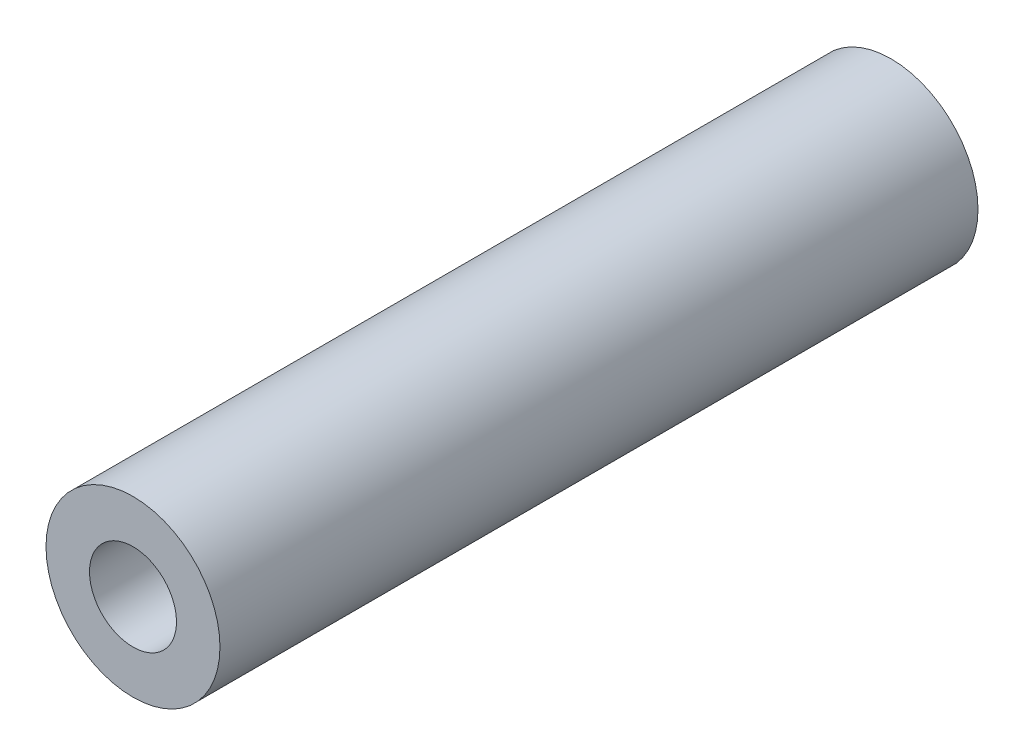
ISO-10303-21;
HEADER;
FILE_DESCRIPTION(('STEP AP214'),'2;1');
FILE_NAME('part.step','',(''),(''),'','','');
FILE_SCHEMA(('AUTOMOTIVE_DESIGN { 1 0 10303 214 1 1 1 1 }'));
ENDSEC;
DATA;
#1=APPLICATION_CONTEXT('core data for automotive mechanical design processes');
#2=APPLICATION_PROTOCOL_DEFINITION('international standard','automotive_design',2000,#1);
#3=PRODUCT_CONTEXT('',#1,'mechanical');
#4=PRODUCT('Part','Part','',(#3));
#5=PRODUCT_RELATED_PRODUCT_CATEGORY('part','',(#4));
#6=PRODUCT_DEFINITION_FORMATION('','',#4);
#7=PRODUCT_DEFINITION_CONTEXT('part definition',#1,'design');
#8=PRODUCT_DEFINITION('design','',#6,#7);
#9=PRODUCT_DEFINITION_SHAPE('','',#8);
#10=(LENGTH_UNIT() NAMED_UNIT(*) SI_UNIT(.MILLI.,.METRE.));
#11=(NAMED_UNIT(*) PLANE_ANGLE_UNIT() SI_UNIT($,.RADIAN.));
#12=(NAMED_UNIT(*) SI_UNIT($,.STERADIAN.) SOLID_ANGLE_UNIT());
#13=UNCERTAINTY_MEASURE_WITH_UNIT(LENGTH_MEASURE(1.E-05),#10,'distance_accuracy_value','');
#14=(GEOMETRIC_REPRESENTATION_CONTEXT(3) GLOBAL_UNCERTAINTY_ASSIGNED_CONTEXT((#13)) GLOBAL_UNIT_ASSIGNED_CONTEXT((#10,
#11,#12)) REPRESENTATION_CONTEXT('',''));
#15=CARTESIAN_POINT('',(0.,0.,0.));
#16=DIRECTION('',(0.,0.,1.));
#17=DIRECTION('',(1.,0.,0.));
#18=AXIS2_PLACEMENT_3D('',#15,#16,#17);
#19=CARTESIAN_POINT('',(0.,0.,15.25));
#20=DIRECTION('',(0.,0.,1.));
#21=DIRECTION('',(1.,0.,0.));
#22=AXIS2_PLACEMENT_3D('',#19,#20,#21);
#23=PLANE('',#22);
#24=CARTESIAN_POINT('',(0.,0.,15.25));
#25=DIRECTION('',(0.,0.,1.));
#26=DIRECTION('',(1.,0.,0.));
#27=AXIS2_PLACEMENT_3D('',#24,#25,#26);
#28=CIRCLE('',#27,3.5);
#29=CARTESIAN_POINT('',(-3.5,0.,15.25));
#30=VERTEX_POINT('',#29);
#31=EDGE_CURVE('E10',#30,#30,#28,.T.);
#32=ORIENTED_EDGE('',*,*,#31,.T.);
#33=EDGE_LOOP('',(#32));
#34=FACE_BOUND('',#33,.T.);
#35=CARTESIAN_POINT('',(0.,0.,15.25));
#36=DIRECTION('',(0.,0.,1.));
#37=DIRECTION('',(1.,0.,0.));
#38=AXIS2_PLACEMENT_3D('',#35,#36,#37);
#39=CIRCLE('',#38,1.75);
#40=CARTESIAN_POINT('',(-1.75,0.,15.25));
#41=VERTEX_POINT('',#40);
#42=EDGE_CURVE('E42',#41,#41,#39,.T.);
#43=ORIENTED_EDGE('',*,*,#42,.F.);
#44=EDGE_LOOP('',(#43));
#45=FACE_BOUND('',#44,.T.);
#46=ADVANCED_FACE('F31',(#34,#45),#23,.T.);
#47=CARTESIAN_POINT('',(0.,0.,-15.25));
#48=DIRECTION('',(0.,0.,1.));
#49=DIRECTION('',(1.,0.,0.));
#50=AXIS2_PLACEMENT_3D('',#47,#48,#49);
#51=PLANE('',#50);
#52=CARTESIAN_POINT('',(0.,0.,-15.25));
#53=DIRECTION('',(0.,0.,1.));
#54=DIRECTION('',(1.,0.,0.));
#55=AXIS2_PLACEMENT_3D('',#52,#53,#54);
#56=CIRCLE('',#55,3.5);
#57=CARTESIAN_POINT('',(-3.5,0.,-15.25));
#58=VERTEX_POINT('',#57);
#59=EDGE_CURVE('E35',#58,#58,#56,.T.);
#60=ORIENTED_EDGE('',*,*,#59,.F.);
#61=EDGE_LOOP('',(#60));
#62=FACE_BOUND('',#61,.T.);
#63=CARTESIAN_POINT('',(0.,0.,-15.25));
#64=DIRECTION('',(0.,0.,1.));
#65=DIRECTION('',(1.,0.,0.));
#66=AXIS2_PLACEMENT_3D('',#63,#64,#65);
#67=CIRCLE('',#66,1.75);
#68=CARTESIAN_POINT('',(-1.75,0.,-15.25));
#69=VERTEX_POINT('',#68);
#70=EDGE_CURVE('E44',#69,#69,#67,.T.);
#71=ORIENTED_EDGE('',*,*,#70,.T.);
#72=EDGE_LOOP('',(#71));
#73=FACE_BOUND('',#72,.T.);
#74=ADVANCED_FACE('F54',(#62,#73),#51,.F.);
#75=CARTESIAN_POINT('',(0.,0.,15.25));
#76=DIRECTION('',(0.,0.,-1.));
#77=DIRECTION('',(-1.,0.,0.));
#78=AXIS2_PLACEMENT_3D('',#75,#76,#77);
#79=CYLINDRICAL_SURFACE('',#78,3.5);
#80=CARTESIAN_POINT('',(-3.5,0.,15.25));
#81=CARTESIAN_POINT('',(-3.5,0.,14.9322916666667));
#82=CARTESIAN_POINT('',(-3.5,0.,14.6145833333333));
#83=CARTESIAN_POINT('',(-3.5,0.,13.9791666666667));
#84=CARTESIAN_POINT('',(-3.5,0.,13.6614583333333));
#85=CARTESIAN_POINT('',(-3.5,0.,13.0260416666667));
#86=CARTESIAN_POINT('',(-3.5,0.,12.7083333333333));
#87=CARTESIAN_POINT('',(-3.5,0.,12.0729166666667));
#88=CARTESIAN_POINT('',(-3.5,0.,11.7552083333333));
#89=CARTESIAN_POINT('',(-3.5,0.,11.1197916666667));
#90=CARTESIAN_POINT('',(-3.5,0.,10.8020833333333));
#91=CARTESIAN_POINT('',(-3.5,0.,10.1666666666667));
#92=CARTESIAN_POINT('',(-3.5,0.,9.84895833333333));
#93=CARTESIAN_POINT('',(-3.5,0.,9.21354166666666));
#94=CARTESIAN_POINT('',(-3.5,0.,8.89583333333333));
#95=CARTESIAN_POINT('',(-3.5,0.,8.26041666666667));
#96=CARTESIAN_POINT('',(-3.5,0.,7.94270833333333));
#97=CARTESIAN_POINT('',(-3.5,0.,7.30729166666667));
#98=CARTESIAN_POINT('',(-3.5,0.,6.98958333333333));
#99=CARTESIAN_POINT('',(-3.5,0.,6.35416666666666));
#100=CARTESIAN_POINT('',(-3.5,0.,6.03645833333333));
#101=CARTESIAN_POINT('',(-3.5,0.,5.40104166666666));
#102=CARTESIAN_POINT('',(-3.5,0.,5.08333333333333));
#103=CARTESIAN_POINT('',(-3.5,0.,4.44791666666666));
#104=CARTESIAN_POINT('',(-3.5,0.,4.13020833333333));
#105=CARTESIAN_POINT('',(-3.5,0.,3.49479166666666));
#106=CARTESIAN_POINT('',(-3.5,0.,3.17708333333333));
#107=CARTESIAN_POINT('',(-3.5,0.,2.54166666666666));
#108=CARTESIAN_POINT('',(-3.5,0.,2.22395833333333));
#109=CARTESIAN_POINT('',(-3.5,0.,1.58854166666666));
#110=CARTESIAN_POINT('',(-3.5,0.,1.27083333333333));
#111=CARTESIAN_POINT('',(-3.5,0.,0.635416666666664));
#112=CARTESIAN_POINT('',(-3.5,0.,0.31770833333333));
#113=CARTESIAN_POINT('',(-3.5,0.,-0.317708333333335));
#114=CARTESIAN_POINT('',(-3.5,0.,-0.635416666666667));
#115=CARTESIAN_POINT('',(-3.5,0.,-1.27083333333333));
#116=CARTESIAN_POINT('',(-3.5,0.,-1.58854166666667));
#117=CARTESIAN_POINT('',(-3.5,0.,-2.22395833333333));
#118=CARTESIAN_POINT('',(-3.5,0.,-2.54166666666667));
#119=CARTESIAN_POINT('',(-3.5,0.,-3.17708333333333));
#120=CARTESIAN_POINT('',(-3.5,0.,-3.49479166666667));
#121=CARTESIAN_POINT('',(-3.5,0.,-4.13020833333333));
#122=CARTESIAN_POINT('',(-3.5,0.,-4.44791666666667));
#123=CARTESIAN_POINT('',(-3.5,0.,-5.08333333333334));
#124=CARTESIAN_POINT('',(-3.5,0.,-5.40104166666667));
#125=CARTESIAN_POINT('',(-3.5,0.,-6.03645833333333));
#126=CARTESIAN_POINT('',(-3.5,0.,-6.35416666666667));
#127=CARTESIAN_POINT('',(-3.5,0.,-6.98958333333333));
#128=CARTESIAN_POINT('',(-3.5,0.,-7.30729166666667));
#129=CARTESIAN_POINT('',(-3.5,0.,-7.94270833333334));
#130=CARTESIAN_POINT('',(-3.5,0.,-8.26041666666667));
#131=CARTESIAN_POINT('',(-3.5,0.,-8.89583333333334));
#132=CARTESIAN_POINT('',(-3.5,0.,-9.21354166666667));
#133=CARTESIAN_POINT('',(-3.5,0.,-9.84895833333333));
#134=CARTESIAN_POINT('',(-3.5,0.,-10.1666666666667));
#135=CARTESIAN_POINT('',(-3.5,0.,-10.8020833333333));
#136=CARTESIAN_POINT('',(-3.5,0.,-11.1197916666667));
#137=CARTESIAN_POINT('',(-3.5,0.,-11.7552083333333));
#138=CARTESIAN_POINT('',(-3.5,0.,-12.0729166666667));
#139=CARTESIAN_POINT('',(-3.5,0.,-12.7083333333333));
#140=CARTESIAN_POINT('',(-3.5,0.,-13.0260416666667));
#141=CARTESIAN_POINT('',(-3.5,0.,-13.6614583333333));
#142=CARTESIAN_POINT('',(-3.5,0.,-13.9791666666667));
#143=CARTESIAN_POINT('',(-3.5,0.,-14.6145833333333));
#144=CARTESIAN_POINT('',(-3.5,0.,-14.9322916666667));
#145=CARTESIAN_POINT('',(-3.5,0.,-15.25));
#146=B_SPLINE_CURVE_WITH_KNOTS('',3,(#80,#81,#82,#83,#84,#85,#86,#87,#88,#89,#90,#91,#92,#93,
#94,#95,#96,#97,#98,#99,#100,#101,#102,#103,#104,#105,#106,#107,#108,#109,#110,#111,#112,#113,
#114,#115,#116,#117,#118,#119,#120,#121,#122,#123,#124,#125,#126,#127,#128,#129,#130,#131,#132,
#133,#134,#135,#136,#137,#138,#139,#140,#141,#142,#143,#144,#145),.UNSPECIFIED.,.F.,.F.,(4,2,2,
2,2,2,2,2,2,2,2,2,2,2,2,2,2,2,2,2,2,2,2,2,2,2,2,2,2,2,2,2,4),(0.,0.953124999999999,1.90625,
2.859375,3.8125,4.765625,5.71875,6.671875,7.625,8.578125,9.53125,10.484375,11.4375,12.390625,
13.34375,14.296875,15.25,16.203125,17.15625,18.109375,19.0625,20.015625,20.96875,21.921875,
22.875,23.828125,24.78125,25.734375,26.6875,27.640625,28.59375,29.546875,30.5),.UNSPECIFIED.);
#147=EDGE_CURVE('BSEAM33',#30,#58,#146,.T.);
#148=ORIENTED_EDGE('',*,*,#31,.F.);
#149=ORIENTED_EDGE('',*,*,#59,.T.);
#150=ORIENTED_EDGE('',*,*,#147,.T.);
#151=ORIENTED_EDGE('',*,*,#147,.F.);
#152=EDGE_LOOP('',(#148,#150,#149,#151));
#153=FACE_BOUND('',#152,.T.);
#154=ADVANCED_FACE('F33',(#153),#79,.T.);
#155=CARTESIAN_POINT('',(0.,0.,15.25));
#156=DIRECTION('',(0.,0.,-1.));
#157=DIRECTION('',(-1.,0.,0.));
#158=AXIS2_PLACEMENT_3D('',#155,#156,#157);
#159=CYLINDRICAL_SURFACE('',#158,1.75);
#160=CARTESIAN_POINT('',(-1.75,0.,15.25));
#161=CARTESIAN_POINT('',(-1.75,0.,14.9322916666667));
#162=CARTESIAN_POINT('',(-1.75,0.,14.6145833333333));
#163=CARTESIAN_POINT('',(-1.75,0.,13.9791666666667));
#164=CARTESIAN_POINT('',(-1.75,0.,13.6614583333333));
#165=CARTESIAN_POINT('',(-1.75,0.,13.0260416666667));
#166=CARTESIAN_POINT('',(-1.75,0.,12.7083333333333));
#167=CARTESIAN_POINT('',(-1.75,0.,12.0729166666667));
#168=CARTESIAN_POINT('',(-1.75,0.,11.7552083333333));
#169=CARTESIAN_POINT('',(-1.75,0.,11.1197916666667));
#170=CARTESIAN_POINT('',(-1.75,0.,10.8020833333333));
#171=CARTESIAN_POINT('',(-1.75,0.,10.1666666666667));
#172=CARTESIAN_POINT('',(-1.75,0.,9.84895833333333));
#173=CARTESIAN_POINT('',(-1.75,0.,9.21354166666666));
#174=CARTESIAN_POINT('',(-1.75,0.,8.89583333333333));
#175=CARTESIAN_POINT('',(-1.75,0.,8.26041666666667));
#176=CARTESIAN_POINT('',(-1.75,0.,7.94270833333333));
#177=CARTESIAN_POINT('',(-1.75,0.,7.30729166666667));
#178=CARTESIAN_POINT('',(-1.75,0.,6.98958333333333));
#179=CARTESIAN_POINT('',(-1.75,0.,6.35416666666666));
#180=CARTESIAN_POINT('',(-1.75,0.,6.03645833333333));
#181=CARTESIAN_POINT('',(-1.75,0.,5.40104166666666));
#182=CARTESIAN_POINT('',(-1.75,0.,5.08333333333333));
#183=CARTESIAN_POINT('',(-1.75,0.,4.44791666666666));
#184=CARTESIAN_POINT('',(-1.75,0.,4.13020833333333));
#185=CARTESIAN_POINT('',(-1.75,0.,3.49479166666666));
#186=CARTESIAN_POINT('',(-1.75,0.,3.17708333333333));
#187=CARTESIAN_POINT('',(-1.75,0.,2.54166666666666));
#188=CARTESIAN_POINT('',(-1.75,0.,2.22395833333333));
#189=CARTESIAN_POINT('',(-1.75,0.,1.58854166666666));
#190=CARTESIAN_POINT('',(-1.75,0.,1.27083333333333));
#191=CARTESIAN_POINT('',(-1.75,0.,0.635416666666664));
#192=CARTESIAN_POINT('',(-1.75,0.,0.31770833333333));
#193=CARTESIAN_POINT('',(-1.75,0.,-0.317708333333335));
#194=CARTESIAN_POINT('',(-1.75,0.,-0.635416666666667));
#195=CARTESIAN_POINT('',(-1.75,0.,-1.27083333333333));
#196=CARTESIAN_POINT('',(-1.75,0.,-1.58854166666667));
#197=CARTESIAN_POINT('',(-1.75,0.,-2.22395833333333));
#198=CARTESIAN_POINT('',(-1.75,0.,-2.54166666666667));
#199=CARTESIAN_POINT('',(-1.75,0.,-3.17708333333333));
#200=CARTESIAN_POINT('',(-1.75,0.,-3.49479166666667));
#201=CARTESIAN_POINT('',(-1.75,0.,-4.13020833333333));
#202=CARTESIAN_POINT('',(-1.75,0.,-4.44791666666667));
#203=CARTESIAN_POINT('',(-1.75,0.,-5.08333333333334));
#204=CARTESIAN_POINT('',(-1.75,0.,-5.40104166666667));
#205=CARTESIAN_POINT('',(-1.75,0.,-6.03645833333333));
#206=CARTESIAN_POINT('',(-1.75,0.,-6.35416666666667));
#207=CARTESIAN_POINT('',(-1.75,0.,-6.98958333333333));
#208=CARTESIAN_POINT('',(-1.75,0.,-7.30729166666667));
#209=CARTESIAN_POINT('',(-1.75,0.,-7.94270833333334));
#210=CARTESIAN_POINT('',(-1.75,0.,-8.26041666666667));
#211=CARTESIAN_POINT('',(-1.75,0.,-8.89583333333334));
#212=CARTESIAN_POINT('',(-1.75,0.,-9.21354166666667));
#213=CARTESIAN_POINT('',(-1.75,0.,-9.84895833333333));
#214=CARTESIAN_POINT('',(-1.75,0.,-10.1666666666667));
#215=CARTESIAN_POINT('',(-1.75,0.,-10.8020833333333));
#216=CARTESIAN_POINT('',(-1.75,0.,-11.1197916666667));
#217=CARTESIAN_POINT('',(-1.75,0.,-11.7552083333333));
#218=CARTESIAN_POINT('',(-1.75,0.,-12.0729166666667));
#219=CARTESIAN_POINT('',(-1.75,0.,-12.7083333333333));
#220=CARTESIAN_POINT('',(-1.75,0.,-13.0260416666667));
#221=CARTESIAN_POINT('',(-1.75,0.,-13.6614583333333));
#222=CARTESIAN_POINT('',(-1.75,0.,-13.9791666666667));
#223=CARTESIAN_POINT('',(-1.75,0.,-14.6145833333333));
#224=CARTESIAN_POINT('',(-1.75,0.,-14.9322916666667));
#225=CARTESIAN_POINT('',(-1.75,0.,-15.25));
#226=B_SPLINE_CURVE_WITH_KNOTS('',3,(#160,#161,#162,#163,#164,#165,#166,#167,#168,#169,#170,
#171,#172,#173,#174,#175,#176,#177,#178,#179,#180,#181,#182,#183,#184,#185,#186,#187,#188,#189,
#190,#191,#192,#193,#194,#195,#196,#197,#198,#199,#200,#201,#202,#203,#204,#205,#206,#207,#208,
#209,#210,#211,#212,#213,#214,#215,#216,#217,#218,#219,#220,#221,#222,#223,#224,#225),
.UNSPECIFIED.,.F.,.F.,(4,2,2,2,2,2,2,2,2,2,2,2,2,2,2,2,2,2,2,2,2,2,2,2,2,2,2,2,2,2,2,2,4),(0.,
0.953124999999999,1.90625,2.859375,3.8125,4.765625,5.71875,6.671875,7.625,8.578125,9.53125,
10.484375,11.4375,12.390625,13.34375,14.296875,15.25,16.203125,17.15625,18.109375,19.0625,
20.015625,20.96875,21.921875,22.875,23.828125,24.78125,25.734375,26.6875,27.640625,28.59375,
29.546875,30.5),.UNSPECIFIED.);
#227=EDGE_CURVE('BSEAM50',#41,#69,#226,.T.);
#228=ORIENTED_EDGE('',*,*,#42,.T.);
#229=ORIENTED_EDGE('',*,*,#70,.F.);
#230=ORIENTED_EDGE('',*,*,#227,.T.);
#231=ORIENTED_EDGE('',*,*,#227,.F.);
#232=EDGE_LOOP('',(#228,#230,#229,#231));
#233=FACE_BOUND('',#232,.T.);
#234=ADVANCED_FACE('F50',(#233),#159,.F.);
#235=CLOSED_SHELL('',(#46,#74,#154,#234));
#236=MANIFOLD_SOLID_BREP('B2',#235);
#237=ADVANCED_BREP_SHAPE_REPRESENTATION('',(#18,#236),#14);
#238=SHAPE_DEFINITION_REPRESENTATION(#9,#237);
ENDSEC;
END-ISO-10303-21;
